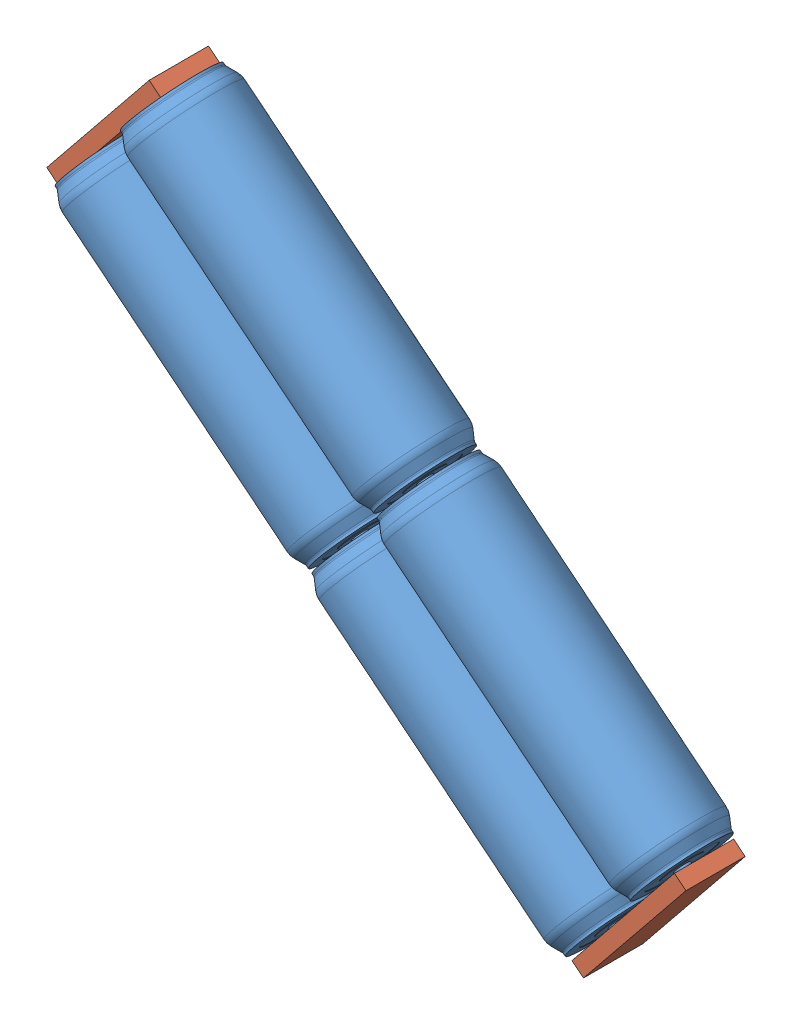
SolidWorks assembly batteries_4_unites.SLDASM, configuration Défaut (file format 4400). Lengths in mm.
Overall size (217.02 194.11 34.92).
6 component instances, 2 part files, 8 mates.
Components (placement in the parent):
- batterie_1_unite-1: batterie_1_unite.SLDPRT [Défaut] at (4.5558 16.0786 14.2424) x (0.777888 -0.628403 0) z (0.627815 0.77716 -0.043251) size (111.4 33.5 33.5)
- batterie_1_unite-2: batterie_1_unite.SLDPRT [Défaut] at (-82.1009 86.0828 14.2424) x (0.777888 -0.628403 0) z (0.628272 0.777724 0.02048) size (111.4 33.5 33.5)
- plaque_contact_pos-1: plaque_contact_pos.SLDPRT [Défaut] at (80.2154 -67.5386 14.2424) x (0 0 -1) z (0.777888 -0.628403 0) size (20 55 5)
- batterie_1_unite-3: batterie_1_unite.SLDPRT [Défaut] at (-104.095 58.8567 14.2424) x (0.777888 -0.628403 0) z (0.628272 0.777724 0.02048) size (111.4 33.5 33.5)
- batterie_1_unite-4: batterie_1_unite.SLDPRT [Défaut] at (-17.4383 -11.1475 14.2424) x (0.777888 -0.628403 0) z (0.627815 0.77716 -0.043251) size (111.4 33.5 33.5)
- plaque_contact_pos-2: plaque_contact_pos.SLDPRT [Défaut] at (-93.0979 72.4697 14.2424) x (0 0 1) z (-0.777888 0.628403 0) size (20 55 5)
Mates (geometry in assembly coordinates):
- Coïncidente1: coincident anti-aligned: plane of batterie_1_unite-1 through (4.5558 16.0786 14.2424) normal (-0.777888 0.628403 0); plane of batterie_1_unite-2 through (4.5558 16.0786 14.2424) normal (0.777888 -0.628403 0)
- Coaxiale1: concentric aligned: cylinder of batterie_1_unite-1 through (101.4152 -62.1676 14.2424) axis (0.777888 -0.628403 0) radius 16.75; cylinder of batterie_1_unite-2 through (14.7585 7.8365 14.2424) axis (0.777888 -0.628403 0) radius 16.75
- Parallèle1: parallel aligned: plane of plaque_contact_pos-1 through (101.386 -49.2887 24.2424) normal (0 0 1); plane of assembly through (0 0 0) normal (0 0 1)
- Coïncidente3: coincident anti-aligned: plane of batterie_1_unite-1 through (91.2125 -53.9255 14.2424) normal (0.777888 -0.628403 0); plane of plaque_contact_pos-1 through (62.9343 -88.9305 24.2424) normal (-0.777888 0.628403 0)
- Coïncidente4: coincident: axis of batterie_1_unite-1 through (82.914 -47.2217 14.2424) axis (0.777888 -0.628403 0); point of plaque_contact_pos-1
- Coïncidente5: coincident aligned: plane of plaque_contact_pos-1 through (101.386 -49.2887 24.2424) normal (0 0 1); plane of plaque_contact_pos-2 through (-79.7063 97.0036 24.2424) normal (0 0 1)
- Coïncidente6: coincident aligned: plane of plaque_contact_pos-1 through (101.386 -49.2887 24.2424) normal (0.628403 0.777888 0); plane of plaque_contact_pos-2 through (-79.7063 97.0036 4.2424) normal (0.628403 0.777888 0)
- Coïncidente7: coincident anti-aligned: plane of batterie_1_unite-3 through (-104.095 58.8567 14.2424) normal (-0.777888 0.628403 0); plane of plaque_contact_pos-2 through (-110.379 51.0778 4.2424) normal (0.777888 -0.628403 0)
